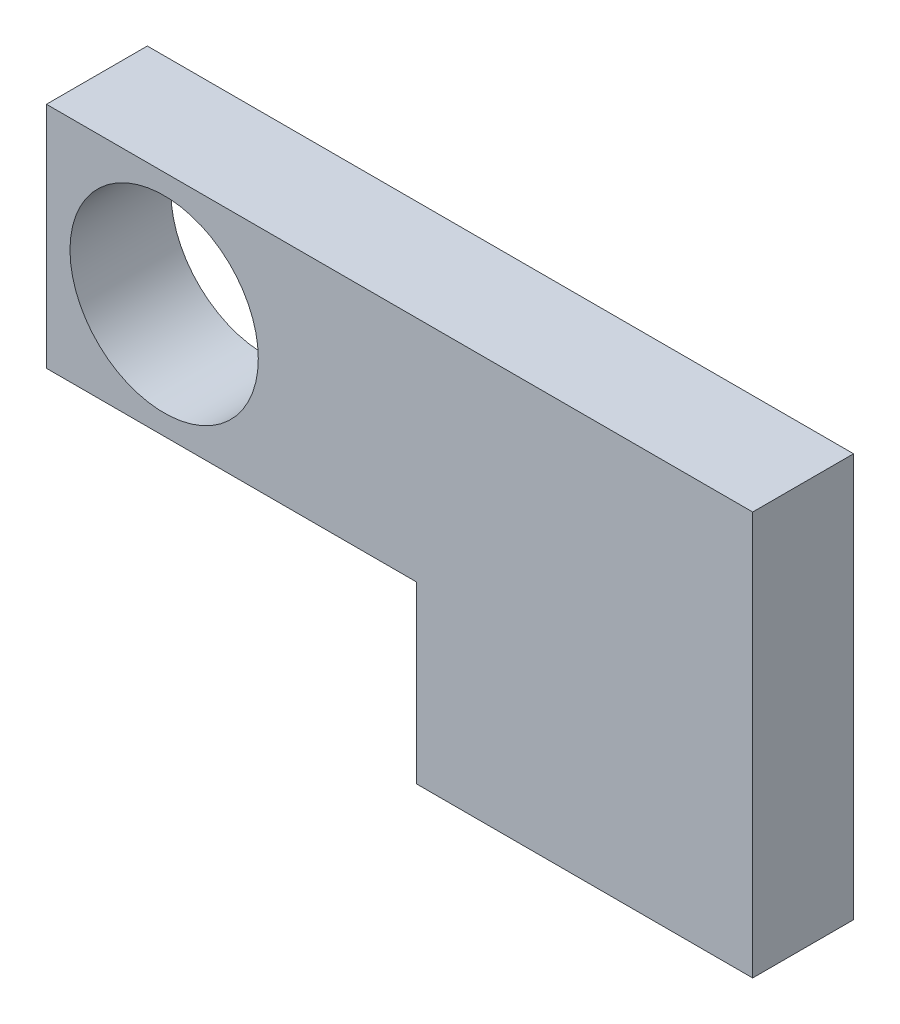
ISO-10303-21;
HEADER;
FILE_DESCRIPTION(('STEP AP214'),'2;1');
FILE_NAME('part.step','',(''),(''),'','','');
FILE_SCHEMA(('AUTOMOTIVE_DESIGN { 1 0 10303 214 1 1 1 1 }'));
ENDSEC;
DATA;
#1=APPLICATION_CONTEXT('core data for automotive mechanical design processes');
#2=APPLICATION_PROTOCOL_DEFINITION('international standard','automotive_design',2000,#1);
#3=PRODUCT_CONTEXT('',#1,'mechanical');
#4=PRODUCT('Part','Part','',(#3));
#5=PRODUCT_RELATED_PRODUCT_CATEGORY('part','',(#4));
#6=PRODUCT_DEFINITION_FORMATION('','',#4);
#7=PRODUCT_DEFINITION_CONTEXT('part definition',#1,'design');
#8=PRODUCT_DEFINITION('design','',#6,#7);
#9=PRODUCT_DEFINITION_SHAPE('','',#8);
#10=(LENGTH_UNIT() NAMED_UNIT(*) SI_UNIT(.MILLI.,.METRE.));
#11=(NAMED_UNIT(*) PLANE_ANGLE_UNIT() SI_UNIT($,.RADIAN.));
#12=(NAMED_UNIT(*) SI_UNIT($,.STERADIAN.) SOLID_ANGLE_UNIT());
#13=UNCERTAINTY_MEASURE_WITH_UNIT(LENGTH_MEASURE(1.E-05),#10,'distance_accuracy_value','');
#14=(GEOMETRIC_REPRESENTATION_CONTEXT(3) GLOBAL_UNCERTAINTY_ASSIGNED_CONTEXT((#13)) GLOBAL_UNIT_ASSIGNED_CONTEXT((#10,
#11,#12)) REPRESENTATION_CONTEXT('',''));
#15=CARTESIAN_POINT('',(0.,0.,0.));
#16=DIRECTION('',(0.,0.,1.));
#17=DIRECTION('',(1.,0.,0.));
#18=AXIS2_PLACEMENT_3D('',#15,#16,#17);
#19=CARTESIAN_POINT('',(0.,59.9999999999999,7.49999999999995));
#20=DIRECTION('',(0.,0.,1.));
#21=DIRECTION('',(1.,0.,0.));
#22=AXIS2_PLACEMENT_3D('',#19,#20,#21);
#23=PLANE('',#22);
#24=DIRECTION('',(0.,1.,0.));
#25=VECTOR('',#24,1.);
#26=CARTESIAN_POINT('',(0.,59.9999999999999,7.49999999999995));
#27=LINE('',#26,#25);
#28=CARTESIAN_POINT('',(0.,0.,7.49999999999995));
#29=VERTEX_POINT('',#28);
#30=CARTESIAN_POINT('',(0.,59.9999999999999,7.49999999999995));
#31=VERTEX_POINT('',#30);
#32=EDGE_CURVE('E134',#29,#31,#27,.T.);
#33=ORIENTED_EDGE('',*,*,#32,.T.);
#34=DIRECTION('',(-1.,0.,0.));
#35=VECTOR('',#34,1.);
#36=CARTESIAN_POINT('',(-105.,59.9999999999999,7.49999999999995));
#37=LINE('',#36,#35);
#38=CARTESIAN_POINT('',(-105.,59.9999999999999,7.49999999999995));
#39=VERTEX_POINT('',#38);
#40=EDGE_CURVE('E107',#31,#39,#37,.T.);
#41=ORIENTED_EDGE('',*,*,#40,.T.);
#42=DIRECTION('',(0.,-1.,0.));
#43=VECTOR('',#42,1.);
#44=CARTESIAN_POINT('',(-105.,26.,7.49999999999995));
#45=LINE('',#44,#43);
#46=CARTESIAN_POINT('',(-105.,26.,7.49999999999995));
#47=VERTEX_POINT('',#46);
#48=EDGE_CURVE('E139',#39,#47,#45,.T.);
#49=ORIENTED_EDGE('',*,*,#48,.T.);
#50=DIRECTION('',(1.,0.,0.));
#51=VECTOR('',#50,1.);
#52=CARTESIAN_POINT('',(-50.,26.,7.49999999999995));
#53=LINE('',#52,#51);
#54=CARTESIAN_POINT('',(-50.,26.,7.49999999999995));
#55=VERTEX_POINT('',#54);
#56=EDGE_CURVE('E141',#47,#55,#53,.T.);
#57=ORIENTED_EDGE('',*,*,#56,.T.);
#58=DIRECTION('',(0.,-1.,0.));
#59=VECTOR('',#58,1.);
#60=CARTESIAN_POINT('',(-50.,0.,7.49999999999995));
#61=LINE('',#60,#59);
#62=CARTESIAN_POINT('',(-50.,0.,7.49999999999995));
#63=VERTEX_POINT('',#62);
#64=EDGE_CURVE('E59',#55,#63,#61,.T.);
#65=ORIENTED_EDGE('',*,*,#64,.T.);
#66=DIRECTION('',(1.,0.,0.));
#67=VECTOR('',#66,1.);
#68=CARTESIAN_POINT('',(0.,0.,7.49999999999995));
#69=LINE('',#68,#67);
#70=EDGE_CURVE('E54',#63,#29,#69,.T.);
#71=ORIENTED_EDGE('',*,*,#70,.T.);
#72=EDGE_LOOP('',(#33,#41,#49,#57,#65,#71));
#73=FACE_BOUND('',#72,.T.);
#74=CARTESIAN_POINT('',(-87.5,43.,7.49999999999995));
#75=DIRECTION('',(0.,0.,1.));
#76=DIRECTION('',(1.,0.,0.));
#77=AXIS2_PLACEMENT_3D('',#74,#75,#76);
#78=CIRCLE('',#77,14.);
#79=CARTESIAN_POINT('',(-73.5,43.,7.49999999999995));
#80=VERTEX_POINT('',#79);
#81=EDGE_CURVE('E113',#80,#80,#78,.T.);
#82=ORIENTED_EDGE('',*,*,#81,.F.);
#83=EDGE_LOOP('',(#82));
#84=FACE_BOUND('',#83,.T.);
#85=ADVANCED_FACE('F38',(#73,#84),#23,.T.);
#86=CARTESIAN_POINT('',(0.,59.9999999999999,-7.49999999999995));
#87=DIRECTION('',(0.,0.,1.));
#88=DIRECTION('',(1.,0.,0.));
#89=AXIS2_PLACEMENT_3D('',#86,#87,#88);
#90=PLANE('',#89);
#91=DIRECTION('',(0.,1.,0.));
#92=VECTOR('',#91,1.);
#93=CARTESIAN_POINT('',(0.,59.9999999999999,-7.49999999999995));
#94=LINE('',#93,#92);
#95=CARTESIAN_POINT('',(0.,0.,-7.49999999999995));
#96=VERTEX_POINT('',#95);
#97=CARTESIAN_POINT('',(0.,59.9999999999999,-7.49999999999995));
#98=VERTEX_POINT('',#97);
#99=EDGE_CURVE('E97',#96,#98,#94,.T.);
#100=ORIENTED_EDGE('',*,*,#99,.F.);
#101=DIRECTION('',(1.,0.,0.));
#102=VECTOR('',#101,1.);
#103=CARTESIAN_POINT('',(0.,0.,-7.49999999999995));
#104=LINE('',#103,#102);
#105=CARTESIAN_POINT('',(-50.,0.,-7.49999999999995));
#106=VERTEX_POINT('',#105);
#107=EDGE_CURVE('E131',#106,#96,#104,.T.);
#108=ORIENTED_EDGE('',*,*,#107,.F.);
#109=DIRECTION('',(0.,-1.,0.));
#110=VECTOR('',#109,1.);
#111=CARTESIAN_POINT('',(-50.,0.,-7.49999999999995));
#112=LINE('',#111,#110);
#113=CARTESIAN_POINT('',(-50.,26.,-7.49999999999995));
#114=VERTEX_POINT('',#113);
#115=EDGE_CURVE('E128',#114,#106,#112,.T.);
#116=ORIENTED_EDGE('',*,*,#115,.F.);
#117=DIRECTION('',(1.,0.,0.));
#118=VECTOR('',#117,1.);
#119=CARTESIAN_POINT('',(-50.,26.,-7.49999999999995));
#120=LINE('',#119,#118);
#121=CARTESIAN_POINT('',(-105.,26.,-7.49999999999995));
#122=VERTEX_POINT('',#121);
#123=EDGE_CURVE('E125',#122,#114,#120,.T.);
#124=ORIENTED_EDGE('',*,*,#123,.F.);
#125=DIRECTION('',(0.,-1.,0.));
#126=VECTOR('',#125,1.);
#127=CARTESIAN_POINT('',(-105.,26.,-7.49999999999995));
#128=LINE('',#127,#126);
#129=CARTESIAN_POINT('',(-105.,59.9999999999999,-7.49999999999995));
#130=VERTEX_POINT('',#129);
#131=EDGE_CURVE('E99',#130,#122,#128,.T.);
#132=ORIENTED_EDGE('',*,*,#131,.F.);
#133=DIRECTION('',(-1.,0.,0.));
#134=VECTOR('',#133,1.);
#135=CARTESIAN_POINT('',(-105.,59.9999999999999,-7.49999999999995));
#136=LINE('',#135,#134);
#137=EDGE_CURVE('E92',#98,#130,#136,.T.);
#138=ORIENTED_EDGE('',*,*,#137,.F.);
#139=EDGE_LOOP('',(#100,#108,#116,#124,#132,#138));
#140=FACE_BOUND('',#139,.T.);
#141=CARTESIAN_POINT('',(-87.5,43.,-7.49999999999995));
#142=DIRECTION('',(0.,0.,1.));
#143=DIRECTION('',(1.,0.,0.));
#144=AXIS2_PLACEMENT_3D('',#141,#142,#143);
#145=CIRCLE('',#144,14.);
#146=CARTESIAN_POINT('',(-73.5,43.,-7.49999999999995));
#147=VERTEX_POINT('',#146);
#148=EDGE_CURVE('E119',#147,#147,#145,.T.);
#149=ORIENTED_EDGE('',*,*,#148,.T.);
#150=EDGE_LOOP('',(#149));
#151=FACE_BOUND('',#150,.T.);
#152=ADVANCED_FACE('F93',(#140,#151),#90,.F.);
#153=CARTESIAN_POINT('',(0.,59.9999999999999,7.49999999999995));
#154=DIRECTION('',(-1.,0.,0.));
#155=DIRECTION('',(0.,-1.,0.));
#156=AXIS2_PLACEMENT_3D('',#153,#154,#155);
#157=PLANE('',#156);
#158=ORIENTED_EDGE('',*,*,#99,.T.);
#159=DIRECTION('',(0.,0.,-1.));
#160=VECTOR('',#159,1.);
#161=CARTESIAN_POINT('',(0.,59.9999999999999,7.49999999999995));
#162=LINE('',#161,#160);
#163=EDGE_CURVE('E11',#31,#98,#162,.T.);
#164=ORIENTED_EDGE('',*,*,#163,.F.);
#165=ORIENTED_EDGE('',*,*,#32,.F.);
#166=DIRECTION('',(0.,0.,-1.));
#167=VECTOR('',#166,1.);
#168=CARTESIAN_POINT('',(0.,0.,7.49999999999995));
#169=LINE('',#168,#167);
#170=EDGE_CURVE('E111',#29,#96,#169,.T.);
#171=ORIENTED_EDGE('',*,*,#170,.T.);
#172=EDGE_LOOP('',(#158,#164,#165,#171));
#173=FACE_BOUND('',#172,.T.);
#174=ADVANCED_FACE('F40',(#173),#157,.F.);
#175=CARTESIAN_POINT('',(-105.,59.9999999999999,7.49999999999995));
#176=DIRECTION('',(0.,-1.,0.));
#177=DIRECTION('',(0.,0.,-1.));
#178=AXIS2_PLACEMENT_3D('',#175,#176,#177);
#179=PLANE('',#178);
#180=ORIENTED_EDGE('',*,*,#137,.T.);
#181=DIRECTION('',(0.,0.,-1.));
#182=VECTOR('',#181,1.);
#183=CARTESIAN_POINT('',(-105.,59.9999999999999,7.49999999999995));
#184=LINE('',#183,#182);
#185=EDGE_CURVE('E47',#39,#130,#184,.T.);
#186=ORIENTED_EDGE('',*,*,#185,.F.);
#187=ORIENTED_EDGE('',*,*,#40,.F.);
#188=ORIENTED_EDGE('',*,*,#163,.T.);
#189=EDGE_LOOP('',(#180,#186,#187,#188));
#190=FACE_BOUND('',#189,.T.);
#191=ADVANCED_FACE('F106',(#190),#179,.F.);
#192=CARTESIAN_POINT('',(-105.,26.,7.49999999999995));
#193=DIRECTION('',(1.,0.,0.));
#194=DIRECTION('',(0.,0.,-1.));
#195=AXIS2_PLACEMENT_3D('',#192,#193,#194);
#196=PLANE('',#195);
#197=ORIENTED_EDGE('',*,*,#131,.T.);
#198=DIRECTION('',(0.,0.,-1.));
#199=VECTOR('',#198,1.);
#200=CARTESIAN_POINT('',(-105.,26.,7.49999999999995));
#201=LINE('',#200,#199);
#202=EDGE_CURVE('E158',#47,#122,#201,.T.);
#203=ORIENTED_EDGE('',*,*,#202,.F.);
#204=ORIENTED_EDGE('',*,*,#48,.F.);
#205=ORIENTED_EDGE('',*,*,#185,.T.);
#206=EDGE_LOOP('',(#197,#203,#204,#205));
#207=FACE_BOUND('',#206,.T.);
#208=ADVANCED_FACE('F164',(#207),#196,.F.);
#209=CARTESIAN_POINT('',(-50.,26.,7.49999999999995));
#210=DIRECTION('',(0.,1.,0.));
#211=DIRECTION('',(-1.,0.,0.));
#212=AXIS2_PLACEMENT_3D('',#209,#210,#211);
#213=PLANE('',#212);
#214=ORIENTED_EDGE('',*,*,#123,.T.);
#215=DIRECTION('',(0.,0.,-1.));
#216=VECTOR('',#215,1.);
#217=CARTESIAN_POINT('',(-50.,26.,7.49999999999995));
#218=LINE('',#217,#216);
#219=EDGE_CURVE('E154',#55,#114,#218,.T.);
#220=ORIENTED_EDGE('',*,*,#219,.F.);
#221=ORIENTED_EDGE('',*,*,#56,.F.);
#222=ORIENTED_EDGE('',*,*,#202,.T.);
#223=EDGE_LOOP('',(#214,#220,#221,#222));
#224=FACE_BOUND('',#223,.T.);
#225=ADVANCED_FACE('F170',(#224),#213,.F.);
#226=CARTESIAN_POINT('',(-50.,0.,7.49999999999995));
#227=DIRECTION('',(1.,0.,0.));
#228=DIRECTION('',(0.,0.,-1.));
#229=AXIS2_PLACEMENT_3D('',#226,#227,#228);
#230=PLANE('',#229);
#231=ORIENTED_EDGE('',*,*,#115,.T.);
#232=DIRECTION('',(0.,0.,-1.));
#233=VECTOR('',#232,1.);
#234=CARTESIAN_POINT('',(-50.,0.,7.49999999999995));
#235=LINE('',#234,#233);
#236=EDGE_CURVE('E150',#63,#106,#235,.T.);
#237=ORIENTED_EDGE('',*,*,#236,.F.);
#238=ORIENTED_EDGE('',*,*,#64,.F.);
#239=ORIENTED_EDGE('',*,*,#219,.T.);
#240=EDGE_LOOP('',(#231,#237,#238,#239));
#241=FACE_BOUND('',#240,.T.);
#242=ADVANCED_FACE('F173',(#241),#230,.F.);
#243=CARTESIAN_POINT('',(0.,0.,7.49999999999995));
#244=DIRECTION('',(0.,1.,0.));
#245=DIRECTION('',(-1.,0.,0.));
#246=AXIS2_PLACEMENT_3D('',#243,#244,#245);
#247=PLANE('',#246);
#248=ORIENTED_EDGE('',*,*,#107,.T.);
#249=ORIENTED_EDGE('',*,*,#170,.F.);
#250=ORIENTED_EDGE('',*,*,#70,.F.);
#251=ORIENTED_EDGE('',*,*,#236,.T.);
#252=EDGE_LOOP('',(#248,#249,#250,#251));
#253=FACE_BOUND('',#252,.T.);
#254=ADVANCED_FACE('F175',(#253),#247,.F.);
#255=CARTESIAN_POINT('',(-87.5,43.,7.49999999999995));
#256=DIRECTION('',(0.,0.,-1.));
#257=DIRECTION('',(-1.,0.,0.));
#258=AXIS2_PLACEMENT_3D('',#255,#256,#257);
#259=CYLINDRICAL_SURFACE('',#258,14.);
#260=ORIENTED_EDGE('',*,*,#81,.T.);
#261=EDGE_LOOP('',(#260));
#262=FACE_BOUND('',#261,.T.);
#263=ORIENTED_EDGE('',*,*,#148,.F.);
#264=EDGE_LOOP('',(#263));
#265=FACE_BOUND('',#264,.T.);
#266=ADVANCED_FACE('F177',(#262,#265),#259,.F.);
#267=CLOSED_SHELL('',(#85,#152,#174,#191,#208,#225,#242,#254,#266));
#268=MANIFOLD_SOLID_BREP('B2',#267);
#269=ADVANCED_BREP_SHAPE_REPRESENTATION('',(#18,#268),#14);
#270=SHAPE_DEFINITION_REPRESENTATION(#9,#269);
ENDSEC;
END-ISO-10303-21;
